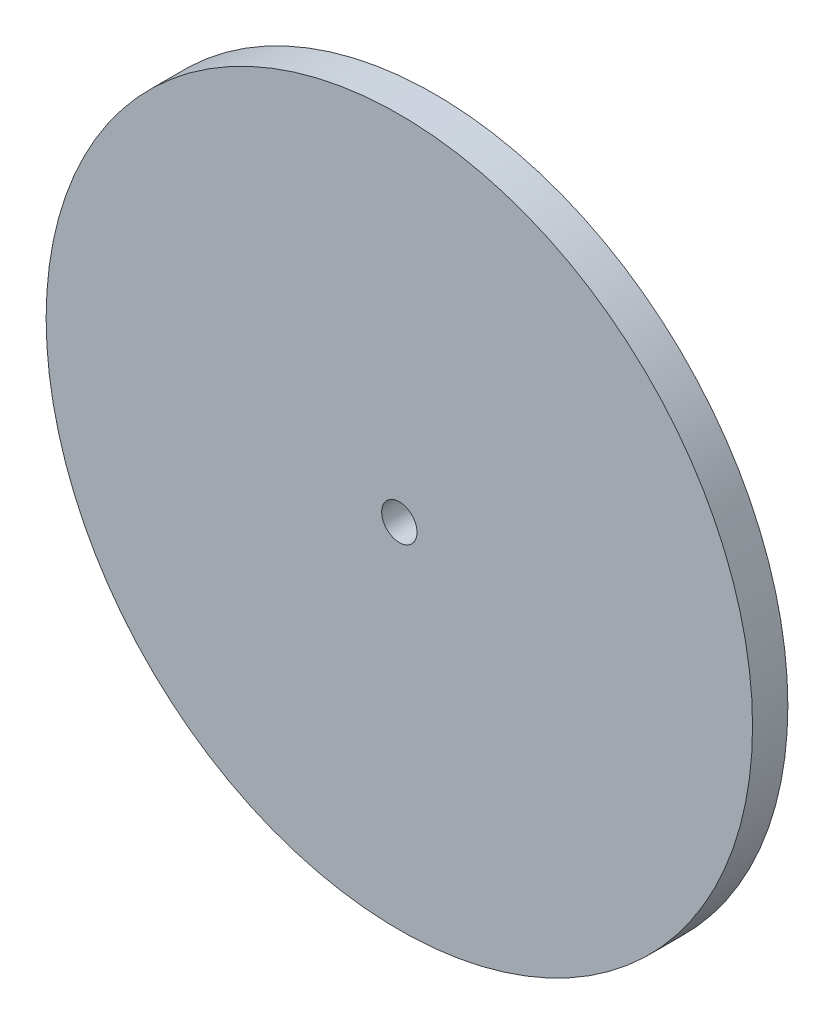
ISO-10303-21;
HEADER;
FILE_DESCRIPTION(('STEP AP214'),'2;1');
FILE_NAME('part.step','',(''),(''),'','','');
FILE_SCHEMA(('AUTOMOTIVE_DESIGN { 1 0 10303 214 1 1 1 1 }'));
ENDSEC;
DATA;
#1=APPLICATION_CONTEXT('core data for automotive mechanical design processes');
#2=APPLICATION_PROTOCOL_DEFINITION('international standard','automotive_design',2000,#1);
#3=PRODUCT_CONTEXT('',#1,'mechanical');
#4=PRODUCT('Part','Part','',(#3));
#5=PRODUCT_RELATED_PRODUCT_CATEGORY('part','',(#4));
#6=PRODUCT_DEFINITION_FORMATION('','',#4);
#7=PRODUCT_DEFINITION_CONTEXT('part definition',#1,'design');
#8=PRODUCT_DEFINITION('design','',#6,#7);
#9=PRODUCT_DEFINITION_SHAPE('','',#8);
#10=(LENGTH_UNIT() NAMED_UNIT(*) SI_UNIT(.MILLI.,.METRE.));
#11=(NAMED_UNIT(*) PLANE_ANGLE_UNIT() SI_UNIT($,.RADIAN.));
#12=(NAMED_UNIT(*) SI_UNIT($,.STERADIAN.) SOLID_ANGLE_UNIT());
#13=UNCERTAINTY_MEASURE_WITH_UNIT(LENGTH_MEASURE(1.E-05),#10,'distance_accuracy_value','');
#14=(GEOMETRIC_REPRESENTATION_CONTEXT(3) GLOBAL_UNCERTAINTY_ASSIGNED_CONTEXT((#13)) GLOBAL_UNIT_ASSIGNED_CONTEXT((#10,
#11,#12)) REPRESENTATION_CONTEXT('',''));
#15=CARTESIAN_POINT('',(0.,0.,0.));
#16=DIRECTION('',(0.,0.,1.));
#17=DIRECTION('',(1.,0.,0.));
#18=AXIS2_PLACEMENT_3D('',#15,#16,#17);
#19=CARTESIAN_POINT('',(0.,0.,30.));
#20=DIRECTION('',(0.,0.,1.));
#21=DIRECTION('',(1.,0.,0.));
#22=AXIS2_PLACEMENT_3D('',#19,#20,#21);
#23=PLANE('',#22);
#24=CARTESIAN_POINT('',(0.,0.,30.));
#25=DIRECTION('',(0.,0.,1.));
#26=DIRECTION('',(1.,0.,0.));
#27=AXIS2_PLACEMENT_3D('',#24,#25,#26);
#28=CIRCLE('',#27,300.);
#29=CARTESIAN_POINT('',(300.,0.,30.));
#30=VERTEX_POINT('',#29);
#31=EDGE_CURVE('E10',#30,#30,#28,.T.);
#32=ORIENTED_EDGE('',*,*,#31,.T.);
#33=EDGE_LOOP('',(#32));
#34=FACE_BOUND('',#33,.T.);
#35=CARTESIAN_POINT('',(0.,0.,30.));
#36=DIRECTION('',(0.,0.,1.));
#37=DIRECTION('',(1.,0.,0.));
#38=AXIS2_PLACEMENT_3D('',#35,#36,#37);
#39=CIRCLE('',#38,15.);
#40=CARTESIAN_POINT('',(15.,0.,30.));
#41=VERTEX_POINT('',#40);
#42=EDGE_CURVE('E41',#41,#41,#39,.T.);
#43=ORIENTED_EDGE('',*,*,#42,.F.);
#44=EDGE_LOOP('',(#43));
#45=FACE_BOUND('',#44,.T.);
#46=ADVANCED_FACE('F30',(#34,#45),#23,.T.);
#47=CARTESIAN_POINT('',(0.,0.,0.));
#48=DIRECTION('',(0.,0.,1.));
#49=DIRECTION('',(1.,0.,0.));
#50=AXIS2_PLACEMENT_3D('',#47,#48,#49);
#51=PLANE('',#50);
#52=CARTESIAN_POINT('',(0.,0.,0.));
#53=DIRECTION('',(0.,0.,1.));
#54=DIRECTION('',(1.,0.,0.));
#55=AXIS2_PLACEMENT_3D('',#52,#53,#54);
#56=CIRCLE('',#55,300.);
#57=CARTESIAN_POINT('',(300.,0.,0.));
#58=VERTEX_POINT('',#57);
#59=EDGE_CURVE('E34',#58,#58,#56,.T.);
#60=ORIENTED_EDGE('',*,*,#59,.F.);
#61=EDGE_LOOP('',(#60));
#62=FACE_BOUND('',#61,.T.);
#63=CARTESIAN_POINT('',(0.,0.,0.));
#64=DIRECTION('',(0.,0.,1.));
#65=DIRECTION('',(1.,0.,0.));
#66=AXIS2_PLACEMENT_3D('',#63,#64,#65);
#67=CIRCLE('',#66,15.);
#68=CARTESIAN_POINT('',(15.,0.,0.));
#69=VERTEX_POINT('',#68);
#70=EDGE_CURVE('E43',#69,#69,#67,.T.);
#71=ORIENTED_EDGE('',*,*,#70,.T.);
#72=EDGE_LOOP('',(#71));
#73=FACE_BOUND('',#72,.T.);
#74=ADVANCED_FACE('F53',(#62,#73),#51,.F.);
#75=CARTESIAN_POINT('',(0.,0.,30.));
#76=DIRECTION('',(0.,0.,-1.));
#77=DIRECTION('',(-1.,0.,0.));
#78=AXIS2_PLACEMENT_3D('',#75,#76,#77);
#79=CYLINDRICAL_SURFACE('',#78,300.);
#80=ORIENTED_EDGE('',*,*,#31,.F.);
#81=EDGE_LOOP('',(#80));
#82=FACE_BOUND('',#81,.T.);
#83=ORIENTED_EDGE('',*,*,#59,.T.);
#84=EDGE_LOOP('',(#83));
#85=FACE_BOUND('',#84,.T.);
#86=ADVANCED_FACE('F32',(#82,#85),#79,.T.);
#87=CARTESIAN_POINT('',(0.,0.,30.));
#88=DIRECTION('',(0.,0.,-1.));
#89=DIRECTION('',(-1.,0.,0.));
#90=AXIS2_PLACEMENT_3D('',#87,#88,#89);
#91=CYLINDRICAL_SURFACE('',#90,15.);
#92=ORIENTED_EDGE('',*,*,#42,.T.);
#93=EDGE_LOOP('',(#92));
#94=FACE_BOUND('',#93,.T.);
#95=ORIENTED_EDGE('',*,*,#70,.F.);
#96=EDGE_LOOP('',(#95));
#97=FACE_BOUND('',#96,.T.);
#98=ADVANCED_FACE('F49',(#94,#97),#91,.F.);
#99=CLOSED_SHELL('',(#46,#74,#86,#98));
#100=MANIFOLD_SOLID_BREP('B2',#99);
#101=ADVANCED_BREP_SHAPE_REPRESENTATION('',(#18,#100),#14);
#102=SHAPE_DEFINITION_REPRESENTATION(#9,#101);
ENDSEC;
END-ISO-10303-21;
